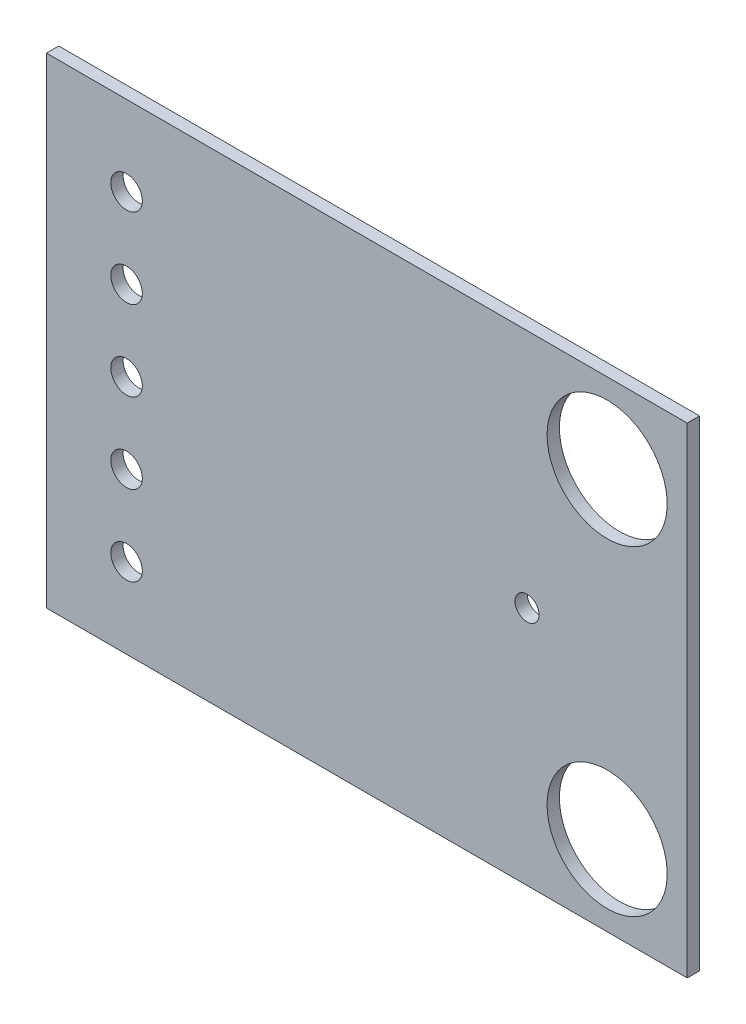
ISO-10303-21;
HEADER;
FILE_DESCRIPTION(('STEP AP214'),'2;1');
FILE_NAME('part.step','',(''),(''),'','','');
FILE_SCHEMA(('AUTOMOTIVE_DESIGN { 1 0 10303 214 1 1 1 1 }'));
ENDSEC;
DATA;
#1=APPLICATION_CONTEXT('core data for automotive mechanical design processes');
#2=APPLICATION_PROTOCOL_DEFINITION('international standard','automotive_design',2000,#1);
#3=PRODUCT_CONTEXT('',#1,'mechanical');
#4=PRODUCT('Part','Part','',(#3));
#5=PRODUCT_RELATED_PRODUCT_CATEGORY('part','',(#4));
#6=PRODUCT_DEFINITION_FORMATION('','',#4);
#7=PRODUCT_DEFINITION_CONTEXT('part definition',#1,'design');
#8=PRODUCT_DEFINITION('design','',#6,#7);
#9=PRODUCT_DEFINITION_SHAPE('','',#8);
#10=(LENGTH_UNIT() NAMED_UNIT(*) SI_UNIT(.MILLI.,.METRE.));
#11=(NAMED_UNIT(*) PLANE_ANGLE_UNIT() SI_UNIT($,.RADIAN.));
#12=(NAMED_UNIT(*) SI_UNIT($,.STERADIAN.) SOLID_ANGLE_UNIT());
#13=UNCERTAINTY_MEASURE_WITH_UNIT(LENGTH_MEASURE(1.E-05),#10,'distance_accuracy_value','');
#14=(GEOMETRIC_REPRESENTATION_CONTEXT(3) GLOBAL_UNCERTAINTY_ASSIGNED_CONTEXT((#13)) GLOBAL_UNIT_ASSIGNED_CONTEXT((#10,
#11,#12)) REPRESENTATION_CONTEXT('',''));
#15=CARTESIAN_POINT('',(0.,0.,0.));
#16=DIRECTION('',(0.,0.,1.));
#17=DIRECTION('',(1.,0.,0.));
#18=AXIS2_PLACEMENT_3D('',#15,#16,#17);
#19=CARTESIAN_POINT('',(0.,0.,0.39116));
#20=DIRECTION('',(0.,0.,-1.));
#21=DIRECTION('',(-1.,0.,0.));
#22=AXIS2_PLACEMENT_3D('',#19,#20,#21);
#23=PLANE('',#22);
#24=CARTESIAN_POINT('',(17.78,12.7,0.39116));
#25=DIRECTION('',(0.,0.,-1.));
#26=DIRECTION('',(-1.,0.,0.));
#27=AXIS2_PLACEMENT_3D('',#24,#25,#26);
#28=CIRCLE('',#27,1.905);
#29=CARTESIAN_POINT('',(15.875,12.7,0.39116));
#30=VERTEX_POINT('',#29);
#31=EDGE_CURVE('E102',#30,#30,#28,.T.);
#32=ORIENTED_EDGE('',*,*,#31,.T.);
#33=EDGE_LOOP('',(#32));
#34=FACE_BOUND('',#33,.T.);
#35=CARTESIAN_POINT('',(2.54,12.7,0.39116));
#36=DIRECTION('',(0.,0.,-1.));
#37=DIRECTION('',(-1.,0.,0.));
#38=AXIS2_PLACEMENT_3D('',#35,#36,#37);
#39=CIRCLE('',#38,0.499999);
#40=CARTESIAN_POINT('',(2.040001,12.7,0.39116));
#41=VERTEX_POINT('',#40);
#42=EDGE_CURVE('E106',#41,#41,#39,.T.);
#43=ORIENTED_EDGE('',*,*,#42,.T.);
#44=EDGE_LOOP('',(#43));
#45=FACE_BOUND('',#44,.T.);
#46=CARTESIAN_POINT('',(17.78,2.54,0.39116));
#47=DIRECTION('',(0.,0.,-1.));
#48=DIRECTION('',(-1.,0.,0.));
#49=AXIS2_PLACEMENT_3D('',#46,#47,#48);
#50=CIRCLE('',#49,1.905);
#51=CARTESIAN_POINT('',(15.875,2.54,0.39116));
#52=VERTEX_POINT('',#51);
#53=EDGE_CURVE('E109',#52,#52,#50,.T.);
#54=ORIENTED_EDGE('',*,*,#53,.T.);
#55=EDGE_LOOP('',(#54));
#56=FACE_BOUND('',#55,.T.);
#57=CARTESIAN_POINT('',(15.24,7.62,0.39116));
#58=DIRECTION('',(0.,0.,-1.));
#59=DIRECTION('',(-1.,0.,0.));
#60=AXIS2_PLACEMENT_3D('',#57,#58,#59);
#61=CIRCLE('',#60,0.381);
#62=CARTESIAN_POINT('',(14.859,7.62,0.39116));
#63=VERTEX_POINT('',#62);
#64=EDGE_CURVE('E112',#63,#63,#61,.T.);
#65=ORIENTED_EDGE('',*,*,#64,.T.);
#66=EDGE_LOOP('',(#65));
#67=FACE_BOUND('',#66,.T.);
#68=CARTESIAN_POINT('',(2.54,7.62,0.39116));
#69=DIRECTION('',(0.,0.,-1.));
#70=DIRECTION('',(-1.,0.,0.));
#71=AXIS2_PLACEMENT_3D('',#68,#69,#70);
#72=CIRCLE('',#71,0.499999);
#73=CARTESIAN_POINT('',(2.040001,7.62,0.39116));
#74=VERTEX_POINT('',#73);
#75=EDGE_CURVE('E115',#74,#74,#72,.T.);
#76=ORIENTED_EDGE('',*,*,#75,.T.);
#77=EDGE_LOOP('',(#76));
#78=FACE_BOUND('',#77,.T.);
#79=CARTESIAN_POINT('',(2.54,10.16,0.39116));
#80=DIRECTION('',(0.,0.,-1.));
#81=DIRECTION('',(-1.,0.,0.));
#82=AXIS2_PLACEMENT_3D('',#79,#80,#81);
#83=CIRCLE('',#82,0.499999);
#84=CARTESIAN_POINT('',(2.040001,10.16,0.39116));
#85=VERTEX_POINT('',#84);
#86=EDGE_CURVE('E118',#85,#85,#83,.T.);
#87=ORIENTED_EDGE('',*,*,#86,.T.);
#88=EDGE_LOOP('',(#87));
#89=FACE_BOUND('',#88,.T.);
#90=CARTESIAN_POINT('',(2.54,2.54,0.39116));
#91=DIRECTION('',(0.,0.,-1.));
#92=DIRECTION('',(-1.,0.,0.));
#93=AXIS2_PLACEMENT_3D('',#90,#91,#92);
#94=CIRCLE('',#93,0.499999);
#95=CARTESIAN_POINT('',(2.040001,2.54,0.39116));
#96=VERTEX_POINT('',#95);
#97=EDGE_CURVE('E120',#96,#96,#94,.T.);
#98=ORIENTED_EDGE('',*,*,#97,.T.);
#99=EDGE_LOOP('',(#98));
#100=FACE_BOUND('',#99,.T.);
#101=CARTESIAN_POINT('',(2.54,5.08,0.39116));
#102=DIRECTION('',(0.,0.,-1.));
#103=DIRECTION('',(-1.,0.,0.));
#104=AXIS2_PLACEMENT_3D('',#101,#102,#103);
#105=CIRCLE('',#104,0.499999);
#106=CARTESIAN_POINT('',(2.040001,5.08,0.39116));
#107=VERTEX_POINT('',#106);
#108=EDGE_CURVE('E19',#107,#107,#105,.T.);
#109=ORIENTED_EDGE('',*,*,#108,.T.);
#110=EDGE_LOOP('',(#109));
#111=FACE_BOUND('',#110,.T.);
#112=DIRECTION('',(0.,1.,0.));
#113=VECTOR('',#112,1.);
#114=CARTESIAN_POINT('',(20.32,0.,0.39116));
#115=LINE('',#114,#113);
#116=CARTESIAN_POINT('',(20.32,0.,0.39116));
#117=VERTEX_POINT('',#116);
#118=CARTESIAN_POINT('',(20.32,15.24,0.39116));
#119=VERTEX_POINT('',#118);
#120=EDGE_CURVE('E54',#117,#119,#115,.T.);
#121=ORIENTED_EDGE('',*,*,#120,.T.);
#122=DIRECTION('',(1.,0.,0.));
#123=VECTOR('',#122,1.);
#124=CARTESIAN_POINT('',(20.32,15.24,0.39116));
#125=LINE('',#124,#123);
#126=CARTESIAN_POINT('',(0.,15.24,0.39116));
#127=VERTEX_POINT('',#126);
#128=EDGE_CURVE('E56',#119,#127,#125,.F.);
#129=ORIENTED_EDGE('',*,*,#128,.T.);
#130=DIRECTION('',(0.,1.,0.));
#131=VECTOR('',#130,1.);
#132=CARTESIAN_POINT('',(0.,15.24,0.39116));
#133=LINE('',#132,#131);
#134=CARTESIAN_POINT('',(0.,0.,0.39116));
#135=VERTEX_POINT('',#134);
#136=EDGE_CURVE('E58',#127,#135,#133,.F.);
#137=ORIENTED_EDGE('',*,*,#136,.T.);
#138=DIRECTION('',(1.,0.,0.));
#139=VECTOR('',#138,1.);
#140=CARTESIAN_POINT('',(0.,0.,0.39116));
#141=LINE('',#140,#139);
#142=EDGE_CURVE('E127',#135,#117,#141,.T.);
#143=ORIENTED_EDGE('',*,*,#142,.T.);
#144=EDGE_LOOP('',(#121,#129,#137,#143));
#145=FACE_BOUND('',#144,.T.);
#146=ADVANCED_FACE('F16',(#34,#45,#56,#67,#78,#89,#100,#111,#145),#23,.F.);
#147=CARTESIAN_POINT('',(0.,15.24,0.));
#148=DIRECTION('',(1.,0.,0.));
#149=DIRECTION('',(0.,0.,-1.));
#150=AXIS2_PLACEMENT_3D('',#147,#148,#149);
#151=PLANE('',#150);
#152=DIRECTION('',(0.,0.,1.));
#153=VECTOR('',#152,1.);
#154=CARTESIAN_POINT('',(0.,0.,0.));
#155=LINE('',#154,#153);
#156=CARTESIAN_POINT('',(0.,0.,0.));
#157=VERTEX_POINT('',#156);
#158=EDGE_CURVE('E69',#157,#135,#155,.T.);
#159=ORIENTED_EDGE('',*,*,#158,.T.);
#160=ORIENTED_EDGE('',*,*,#136,.F.);
#161=DIRECTION('',(0.,0.,-1.));
#162=VECTOR('',#161,1.);
#163=CARTESIAN_POINT('',(0.,15.24,0.));
#164=LINE('',#163,#162);
#165=CARTESIAN_POINT('',(0.,15.24,0.));
#166=VERTEX_POINT('',#165);
#167=EDGE_CURVE('E63',#127,#166,#164,.T.);
#168=ORIENTED_EDGE('',*,*,#167,.T.);
#169=DIRECTION('',(0.,1.,0.));
#170=VECTOR('',#169,1.);
#171=CARTESIAN_POINT('',(0.,0.,0.));
#172=LINE('',#171,#170);
#173=EDGE_CURVE('E105',#157,#166,#172,.T.);
#174=ORIENTED_EDGE('',*,*,#173,.F.);
#175=EDGE_LOOP('',(#159,#160,#168,#174));
#176=FACE_BOUND('',#175,.T.);
#177=ADVANCED_FACE('F66',(#176),#151,.F.);
#178=CARTESIAN_POINT('',(20.32,15.24,0.));
#179=DIRECTION('',(0.,-1.,0.));
#180=DIRECTION('',(0.,0.,-1.));
#181=AXIS2_PLACEMENT_3D('',#178,#179,#180);
#182=PLANE('',#181);
#183=ORIENTED_EDGE('',*,*,#167,.F.);
#184=ORIENTED_EDGE('',*,*,#128,.F.);
#185=DIRECTION('',(0.,0.,1.));
#186=VECTOR('',#185,1.);
#187=CARTESIAN_POINT('',(20.32,15.24,0.));
#188=LINE('',#187,#186);
#189=CARTESIAN_POINT('',(20.32,15.24,0.));
#190=VERTEX_POINT('',#189);
#191=EDGE_CURVE('E77',#119,#190,#188,.F.);
#192=ORIENTED_EDGE('',*,*,#191,.T.);
#193=DIRECTION('',(-1.,0.,0.));
#194=VECTOR('',#193,1.);
#195=CARTESIAN_POINT('',(0.,15.24,0.));
#196=LINE('',#195,#194);
#197=EDGE_CURVE('E74',#166,#190,#196,.F.);
#198=ORIENTED_EDGE('',*,*,#197,.F.);
#199=EDGE_LOOP('',(#183,#184,#192,#198));
#200=FACE_BOUND('',#199,.T.);
#201=ADVANCED_FACE('F72',(#200),#182,.F.);
#202=CARTESIAN_POINT('',(20.32,0.,0.));
#203=DIRECTION('',(-1.,0.,0.));
#204=DIRECTION('',(0.,0.,1.));
#205=AXIS2_PLACEMENT_3D('',#202,#203,#204);
#206=PLANE('',#205);
#207=ORIENTED_EDGE('',*,*,#191,.F.);
#208=ORIENTED_EDGE('',*,*,#120,.F.);
#209=DIRECTION('',(0.,0.,1.));
#210=VECTOR('',#209,1.);
#211=CARTESIAN_POINT('',(20.32,0.,0.));
#212=LINE('',#211,#210);
#213=CARTESIAN_POINT('',(20.32,0.,0.));
#214=VERTEX_POINT('',#213);
#215=EDGE_CURVE('E34',#117,#214,#212,.F.);
#216=ORIENTED_EDGE('',*,*,#215,.T.);
#217=DIRECTION('',(0.,1.,0.));
#218=VECTOR('',#217,1.);
#219=CARTESIAN_POINT('',(20.32,0.,0.));
#220=LINE('',#219,#218);
#221=EDGE_CURVE('E134',#190,#214,#220,.F.);
#222=ORIENTED_EDGE('',*,*,#221,.F.);
#223=EDGE_LOOP('',(#207,#208,#216,#222));
#224=FACE_BOUND('',#223,.T.);
#225=ADVANCED_FACE('F135',(#224),#206,.F.);
#226=CARTESIAN_POINT('',(0.,0.,0.));
#227=DIRECTION('',(0.,1.,0.));
#228=DIRECTION('',(0.,0.,1.));
#229=AXIS2_PLACEMENT_3D('',#226,#227,#228);
#230=PLANE('',#229);
#231=ORIENTED_EDGE('',*,*,#215,.F.);
#232=ORIENTED_EDGE('',*,*,#142,.F.);
#233=ORIENTED_EDGE('',*,*,#158,.F.);
#234=DIRECTION('',(-1.,0.,0.));
#235=VECTOR('',#234,1.);
#236=CARTESIAN_POINT('',(0.,0.,0.));
#237=LINE('',#236,#235);
#238=EDGE_CURVE('E101',#214,#157,#237,.T.);
#239=ORIENTED_EDGE('',*,*,#238,.F.);
#240=EDGE_LOOP('',(#231,#232,#233,#239));
#241=FACE_BOUND('',#240,.T.);
#242=ADVANCED_FACE('F142',(#241),#230,.F.);
#243=CARTESIAN_POINT('',(2.54,5.08,0.));
#244=DIRECTION('',(0.,0.,-1.));
#245=DIRECTION('',(-1.,0.,0.));
#246=AXIS2_PLACEMENT_3D('',#243,#244,#245);
#247=CYLINDRICAL_SURFACE('',#246,0.499999);
#248=ORIENTED_EDGE('',*,*,#108,.F.);
#249=EDGE_LOOP('',(#248));
#250=FACE_BOUND('',#249,.T.);
#251=CARTESIAN_POINT('',(2.54,5.08,0.));
#252=DIRECTION('',(0.,0.,-1.));
#253=DIRECTION('',(-1.,0.,0.));
#254=AXIS2_PLACEMENT_3D('',#251,#252,#253);
#255=CIRCLE('',#254,0.499999);
#256=CARTESIAN_POINT('',(2.040001,5.08,0.));
#257=VERTEX_POINT('',#256);
#258=EDGE_CURVE('E98',#257,#257,#255,.F.);
#259=ORIENTED_EDGE('',*,*,#258,.F.);
#260=EDGE_LOOP('',(#259));
#261=FACE_BOUND('',#260,.T.);
#262=ADVANCED_FACE('F144',(#250,#261),#247,.F.);
#263=CARTESIAN_POINT('',(2.54,2.54,0.));
#264=DIRECTION('',(0.,0.,-1.));
#265=DIRECTION('',(-1.,0.,0.));
#266=AXIS2_PLACEMENT_3D('',#263,#264,#265);
#267=CYLINDRICAL_SURFACE('',#266,0.499999);
#268=ORIENTED_EDGE('',*,*,#97,.F.);
#269=EDGE_LOOP('',(#268));
#270=FACE_BOUND('',#269,.T.);
#271=CARTESIAN_POINT('',(2.54,2.54,0.));
#272=DIRECTION('',(0.,0.,-1.));
#273=DIRECTION('',(-1.,0.,0.));
#274=AXIS2_PLACEMENT_3D('',#271,#272,#273);
#275=CIRCLE('',#274,0.499999);
#276=CARTESIAN_POINT('',(2.040001,2.54,0.));
#277=VERTEX_POINT('',#276);
#278=EDGE_CURVE('E95',#277,#277,#275,.F.);
#279=ORIENTED_EDGE('',*,*,#278,.F.);
#280=EDGE_LOOP('',(#279));
#281=FACE_BOUND('',#280,.T.);
#282=ADVANCED_FACE('F151',(#270,#281),#267,.F.);
#283=CARTESIAN_POINT('',(2.54,10.16,0.));
#284=DIRECTION('',(0.,0.,-1.));
#285=DIRECTION('',(-1.,0.,0.));
#286=AXIS2_PLACEMENT_3D('',#283,#284,#285);
#287=CYLINDRICAL_SURFACE('',#286,0.499999);
#288=ORIENTED_EDGE('',*,*,#86,.F.);
#289=EDGE_LOOP('',(#288));
#290=FACE_BOUND('',#289,.T.);
#291=CARTESIAN_POINT('',(2.54,10.16,0.));
#292=DIRECTION('',(0.,0.,-1.));
#293=DIRECTION('',(-1.,0.,0.));
#294=AXIS2_PLACEMENT_3D('',#291,#292,#293);
#295=CIRCLE('',#294,0.499999);
#296=CARTESIAN_POINT('',(2.040001,10.16,0.));
#297=VERTEX_POINT('',#296);
#298=EDGE_CURVE('E92',#297,#297,#295,.F.);
#299=ORIENTED_EDGE('',*,*,#298,.F.);
#300=EDGE_LOOP('',(#299));
#301=FACE_BOUND('',#300,.T.);
#302=ADVANCED_FACE('F181',(#290,#301),#287,.F.);
#303=CARTESIAN_POINT('',(2.54,7.62,0.));
#304=DIRECTION('',(0.,0.,-1.));
#305=DIRECTION('',(-1.,0.,0.));
#306=AXIS2_PLACEMENT_3D('',#303,#304,#305);
#307=CYLINDRICAL_SURFACE('',#306,0.499999);
#308=ORIENTED_EDGE('',*,*,#75,.F.);
#309=EDGE_LOOP('',(#308));
#310=FACE_BOUND('',#309,.T.);
#311=CARTESIAN_POINT('',(2.54,7.62,0.));
#312=DIRECTION('',(0.,0.,-1.));
#313=DIRECTION('',(-1.,0.,0.));
#314=AXIS2_PLACEMENT_3D('',#311,#312,#313);
#315=CIRCLE('',#314,0.499999);
#316=CARTESIAN_POINT('',(2.040001,7.62,0.));
#317=VERTEX_POINT('',#316);
#318=EDGE_CURVE('E89',#317,#317,#315,.F.);
#319=ORIENTED_EDGE('',*,*,#318,.F.);
#320=EDGE_LOOP('',(#319));
#321=FACE_BOUND('',#320,.T.);
#322=ADVANCED_FACE('F177',(#310,#321),#307,.F.);
#323=CARTESIAN_POINT('',(15.24,7.62,0.));
#324=DIRECTION('',(0.,0.,-1.));
#325=DIRECTION('',(-1.,0.,0.));
#326=AXIS2_PLACEMENT_3D('',#323,#324,#325);
#327=CYLINDRICAL_SURFACE('',#326,0.381);
#328=ORIENTED_EDGE('',*,*,#64,.F.);
#329=EDGE_LOOP('',(#328));
#330=FACE_BOUND('',#329,.T.);
#331=CARTESIAN_POINT('',(15.24,7.62,0.));
#332=DIRECTION('',(0.,0.,-1.));
#333=DIRECTION('',(-1.,0.,0.));
#334=AXIS2_PLACEMENT_3D('',#331,#332,#333);
#335=CIRCLE('',#334,0.381);
#336=CARTESIAN_POINT('',(14.859,7.62,0.));
#337=VERTEX_POINT('',#336);
#338=EDGE_CURVE('E86',#337,#337,#335,.F.);
#339=ORIENTED_EDGE('',*,*,#338,.F.);
#340=EDGE_LOOP('',(#339));
#341=FACE_BOUND('',#340,.T.);
#342=ADVANCED_FACE('F173',(#330,#341),#327,.F.);
#343=CARTESIAN_POINT('',(17.78,2.54,0.));
#344=DIRECTION('',(0.,0.,-1.));
#345=DIRECTION('',(-1.,0.,0.));
#346=AXIS2_PLACEMENT_3D('',#343,#344,#345);
#347=CYLINDRICAL_SURFACE('',#346,1.905);
#348=ORIENTED_EDGE('',*,*,#53,.F.);
#349=EDGE_LOOP('',(#348));
#350=FACE_BOUND('',#349,.T.);
#351=CARTESIAN_POINT('',(17.78,2.54,0.));
#352=DIRECTION('',(0.,0.,-1.));
#353=DIRECTION('',(-1.,0.,0.));
#354=AXIS2_PLACEMENT_3D('',#351,#352,#353);
#355=CIRCLE('',#354,1.905);
#356=CARTESIAN_POINT('',(15.875,2.54,0.));
#357=VERTEX_POINT('',#356);
#358=EDGE_CURVE('E83',#357,#357,#355,.F.);
#359=ORIENTED_EDGE('',*,*,#358,.F.);
#360=EDGE_LOOP('',(#359));
#361=FACE_BOUND('',#360,.T.);
#362=ADVANCED_FACE('F169',(#350,#361),#347,.F.);
#363=CARTESIAN_POINT('',(2.54,12.7,0.));
#364=DIRECTION('',(0.,0.,-1.));
#365=DIRECTION('',(-1.,0.,0.));
#366=AXIS2_PLACEMENT_3D('',#363,#364,#365);
#367=CYLINDRICAL_SURFACE('',#366,0.499999);
#368=ORIENTED_EDGE('',*,*,#42,.F.);
#369=EDGE_LOOP('',(#368));
#370=FACE_BOUND('',#369,.T.);
#371=CARTESIAN_POINT('',(2.54,12.7,0.));
#372=DIRECTION('',(0.,0.,-1.));
#373=DIRECTION('',(-1.,0.,0.));
#374=AXIS2_PLACEMENT_3D('',#371,#372,#373);
#375=CIRCLE('',#374,0.499999);
#376=CARTESIAN_POINT('',(2.040001,12.7,0.));
#377=VERTEX_POINT('',#376);
#378=EDGE_CURVE('E25',#377,#377,#375,.F.);
#379=ORIENTED_EDGE('',*,*,#378,.F.);
#380=EDGE_LOOP('',(#379));
#381=FACE_BOUND('',#380,.T.);
#382=ADVANCED_FACE('F162',(#370,#381),#367,.F.);
#383=CARTESIAN_POINT('',(17.78,12.7,0.));
#384=DIRECTION('',(0.,0.,-1.));
#385=DIRECTION('',(-1.,0.,0.));
#386=AXIS2_PLACEMENT_3D('',#383,#384,#385);
#387=CYLINDRICAL_SURFACE('',#386,1.905);
#388=ORIENTED_EDGE('',*,*,#31,.F.);
#389=EDGE_LOOP('',(#388));
#390=FACE_BOUND('',#389,.T.);
#391=CARTESIAN_POINT('',(17.78,12.7,0.));
#392=DIRECTION('',(0.,0.,-1.));
#393=DIRECTION('',(-1.,0.,0.));
#394=AXIS2_PLACEMENT_3D('',#391,#392,#393);
#395=CIRCLE('',#394,1.905);
#396=CARTESIAN_POINT('',(15.875,12.7,0.));
#397=VERTEX_POINT('',#396);
#398=EDGE_CURVE('E10',#397,#397,#395,.F.);
#399=ORIENTED_EDGE('',*,*,#398,.F.);
#400=EDGE_LOOP('',(#399));
#401=FACE_BOUND('',#400,.T.);
#402=ADVANCED_FACE('F156',(#390,#401),#387,.F.);
#403=CARTESIAN_POINT('',(0.,0.,0.));
#404=DIRECTION('',(0.,0.,-1.));
#405=DIRECTION('',(-1.,0.,0.));
#406=AXIS2_PLACEMENT_3D('',#403,#404,#405);
#407=PLANE('',#406);
#408=ORIENTED_EDGE('',*,*,#398,.T.);
#409=EDGE_LOOP('',(#408));
#410=FACE_BOUND('',#409,.T.);
#411=ORIENTED_EDGE('',*,*,#378,.T.);
#412=EDGE_LOOP('',(#411));
#413=FACE_BOUND('',#412,.T.);
#414=ORIENTED_EDGE('',*,*,#358,.T.);
#415=EDGE_LOOP('',(#414));
#416=FACE_BOUND('',#415,.T.);
#417=ORIENTED_EDGE('',*,*,#338,.T.);
#418=EDGE_LOOP('',(#417));
#419=FACE_BOUND('',#418,.T.);
#420=ORIENTED_EDGE('',*,*,#318,.T.);
#421=EDGE_LOOP('',(#420));
#422=FACE_BOUND('',#421,.T.);
#423=ORIENTED_EDGE('',*,*,#298,.T.);
#424=EDGE_LOOP('',(#423));
#425=FACE_BOUND('',#424,.T.);
#426=ORIENTED_EDGE('',*,*,#278,.T.);
#427=EDGE_LOOP('',(#426));
#428=FACE_BOUND('',#427,.T.);
#429=ORIENTED_EDGE('',*,*,#258,.T.);
#430=EDGE_LOOP('',(#429));
#431=FACE_BOUND('',#430,.T.);
#432=ORIENTED_EDGE('',*,*,#221,.T.);
#433=ORIENTED_EDGE('',*,*,#238,.T.);
#434=ORIENTED_EDGE('',*,*,#173,.T.);
#435=ORIENTED_EDGE('',*,*,#197,.T.);
#436=EDGE_LOOP('',(#432,#433,#434,#435));
#437=FACE_BOUND('',#436,.T.);
#438=ADVANCED_FACE('F139',(#410,#413,#416,#419,#422,#425,#428,#431,#437),#407,.T.);
#439=CLOSED_SHELL('',(#146,#177,#201,#225,#242,#262,#282,#302,#322,#342,#362,#382,#402,#438));
#440=MANIFOLD_SOLID_BREP('B1',#439);
#441=ADVANCED_BREP_SHAPE_REPRESENTATION('',(#18,#440),#14);
#442=SHAPE_DEFINITION_REPRESENTATION(#9,#441);
ENDSEC;
END-ISO-10303-21;
